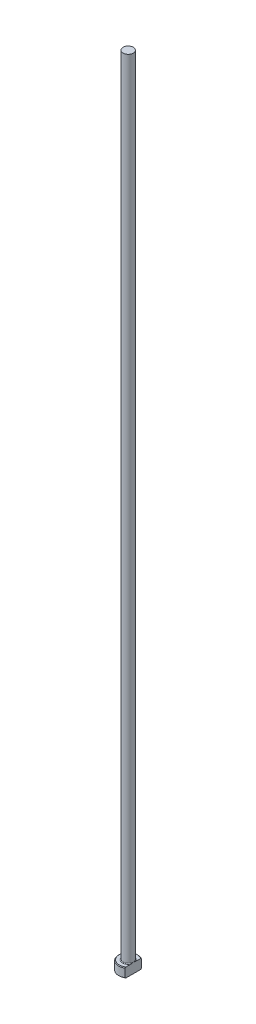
ISO-10303-21;
HEADER;
FILE_DESCRIPTION(('STEP AP214'),'2;1');
FILE_NAME('part.step','',(''),(''),'','','');
FILE_SCHEMA(('AUTOMOTIVE_DESIGN { 1 0 10303 214 1 1 1 1 }'));
ENDSEC;
DATA;
#1=APPLICATION_CONTEXT('core data for automotive mechanical design processes');
#2=APPLICATION_PROTOCOL_DEFINITION('international standard','automotive_design',2000,#1);
#3=PRODUCT_CONTEXT('',#1,'mechanical');
#4=PRODUCT('Part','Part','',(#3));
#5=PRODUCT_RELATED_PRODUCT_CATEGORY('part','',(#4));
#6=PRODUCT_DEFINITION_FORMATION('','',#4);
#7=PRODUCT_DEFINITION_CONTEXT('part definition',#1,'design');
#8=PRODUCT_DEFINITION('design','',#6,#7);
#9=PRODUCT_DEFINITION_SHAPE('','',#8);
#10=(LENGTH_UNIT() NAMED_UNIT(*) SI_UNIT(.MILLI.,.METRE.));
#11=(NAMED_UNIT(*) PLANE_ANGLE_UNIT() SI_UNIT($,.RADIAN.));
#12=(NAMED_UNIT(*) SI_UNIT($,.STERADIAN.) SOLID_ANGLE_UNIT());
#13=UNCERTAINTY_MEASURE_WITH_UNIT(LENGTH_MEASURE(1.E-05),#10,'distance_accuracy_value','');
#14=(GEOMETRIC_REPRESENTATION_CONTEXT(3) GLOBAL_UNCERTAINTY_ASSIGNED_CONTEXT((#13)) GLOBAL_UNIT_ASSIGNED_CONTEXT((#10,
#11,#12)) REPRESENTATION_CONTEXT('',''));
#15=CARTESIAN_POINT('',(0.,0.,0.));
#16=DIRECTION('',(0.,0.,1.));
#17=DIRECTION('',(1.,0.,0.));
#18=AXIS2_PLACEMENT_3D('',#15,#16,#17);
#19=CARTESIAN_POINT('',(0.,0.,0.));
#20=DIRECTION('',(0.,-1.,0.));
#21=DIRECTION('',(0.,0.,-1.));
#22=AXIS2_PLACEMENT_3D('',#19,#20,#21);
#23=PLANE('',#22);
#24=CARTESIAN_POINT('',(0.,0.,0.));
#25=DIRECTION('',(0.,-1.,0.));
#26=DIRECTION('',(0.,0.,-1.));
#27=AXIS2_PLACEMENT_3D('',#24,#25,#26);
#28=CIRCLE('',#27,2.8);
#29=CARTESIAN_POINT('',(1.59999999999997,0.,2.29782505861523));
#30=VERTEX_POINT('',#29);
#31=CARTESIAN_POINT('',(1.59999999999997,0.,-2.29782505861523));
#32=VERTEX_POINT('',#31);
#33=EDGE_CURVE('E98',#30,#32,#28,.T.);
#34=ORIENTED_EDGE('',*,*,#33,.T.);
#35=DIRECTION('',(0.,0.,1.));
#36=VECTOR('',#35,1.);
#37=CARTESIAN_POINT('',(1.59999999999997,0.,-2.53771550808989));
#38=LINE('',#37,#36);
#39=EDGE_CURVE('E83',#32,#30,#38,.T.);
#40=ORIENTED_EDGE('',*,*,#39,.T.);
#41=EDGE_LOOP('',(#34,#40));
#42=FACE_BOUND('',#41,.T.);
#43=ADVANCED_FACE('F32',(#42),#23,.T.);
#44=CARTESIAN_POINT('',(0.,259.958771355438,0.));
#45=DIRECTION('',(0.,1.,0.));
#46=DIRECTION('',(0.,0.,1.));
#47=AXIS2_PLACEMENT_3D('',#44,#45,#46);
#48=CYLINDRICAL_SURFACE('',#47,2.99999999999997);
#49=CARTESIAN_POINT('',(0.,2.80000000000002,0.));
#50=DIRECTION('',(0.,1.,0.));
#51=DIRECTION('',(0.,0.,1.));
#52=AXIS2_PLACEMENT_3D('',#49,#50,#51);
#53=CIRCLE('',#52,2.99999999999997);
#54=CARTESIAN_POINT('',(1.59999999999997,2.80000000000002,2.53771550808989));
#55=VERTEX_POINT('',#54);
#56=CARTESIAN_POINT('',(1.59999999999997,2.80000000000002,-2.53771550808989));
#57=VERTEX_POINT('',#56);
#58=EDGE_CURVE('E104',#55,#57,#53,.F.);
#59=ORIENTED_EDGE('',*,*,#58,.T.);
#60=DIRECTION('',(0.,-1.,0.));
#61=VECTOR('',#60,1.);
#62=CARTESIAN_POINT('',(1.59999999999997,250.,-2.53771550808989));
#63=LINE('',#62,#61);
#64=CARTESIAN_POINT('',(1.59999999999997,0.199999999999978,-2.53771550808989));
#65=VERTEX_POINT('',#64);
#66=EDGE_CURVE('E183',#57,#65,#63,.T.);
#67=ORIENTED_EDGE('',*,*,#66,.T.);
#68=CARTESIAN_POINT('',(0.,0.199999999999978,0.));
#69=DIRECTION('',(0.,-1.,0.));
#70=DIRECTION('',(0.,0.,-1.));
#71=AXIS2_PLACEMENT_3D('',#68,#69,#70);
#72=CIRCLE('',#71,2.99999999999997);
#73=CARTESIAN_POINT('',(1.59999999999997,0.199999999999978,2.53771550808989));
#74=VERTEX_POINT('',#73);
#75=EDGE_CURVE('E100',#65,#74,#72,.F.);
#76=ORIENTED_EDGE('',*,*,#75,.T.);
#77=DIRECTION('',(0.,-1.,0.));
#78=VECTOR('',#77,1.);
#79=CARTESIAN_POINT('',(1.59999999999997,250.,2.53771550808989));
#80=LINE('',#79,#78);
#81=EDGE_CURVE('E93',#55,#74,#80,.T.);
#82=ORIENTED_EDGE('',*,*,#81,.F.);
#83=EDGE_LOOP('',(#59,#67,#76,#82));
#84=FACE_BOUND('',#83,.T.);
#85=ADVANCED_FACE('F158',(#84),#48,.T.);
#86=CARTESIAN_POINT('',(-2.99999999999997,3.,0.));
#87=DIRECTION('',(0.,1.,0.));
#88=DIRECTION('',(0.,0.,1.));
#89=AXIS2_PLACEMENT_3D('',#86,#87,#88);
#90=PLANE('',#89);
#91=CARTESIAN_POINT('',(0.,3.,0.));
#92=DIRECTION('',(0.,1.,0.));
#93=DIRECTION('',(0.,0.,1.));
#94=AXIS2_PLACEMENT_3D('',#91,#92,#93);
#95=CIRCLE('',#94,2.80000000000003);
#96=CARTESIAN_POINT('',(1.59999999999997,3.,-2.29782505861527));
#97=VERTEX_POINT('',#96);
#98=CARTESIAN_POINT('',(1.59999999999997,3.,2.29782505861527));
#99=VERTEX_POINT('',#98);
#100=EDGE_CURVE('E178',#97,#99,#95,.T.);
#101=ORIENTED_EDGE('',*,*,#100,.T.);
#102=DIRECTION('',(0.,0.,-1.));
#103=VECTOR('',#102,1.);
#104=CARTESIAN_POINT('',(1.59999999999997,3.,0.));
#105=LINE('',#104,#103);
#106=CARTESIAN_POINT('',(1.59999999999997,2.99999999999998,0.824621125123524));
#107=VERTEX_POINT('',#106);
#108=EDGE_CURVE('E57',#99,#107,#105,.T.);
#109=ORIENTED_EDGE('',*,*,#108,.T.);
#110=CARTESIAN_POINT('',(0.,3.,0.));
#111=DIRECTION('',(0.,1.,0.));
#112=DIRECTION('',(0.,0.,1.));
#113=AXIS2_PLACEMENT_3D('',#110,#111,#112);
#114=CIRCLE('',#113,1.79999999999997);
#115=CARTESIAN_POINT('',(1.59999999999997,2.99999999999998,-0.824621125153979));
#116=VERTEX_POINT('',#115);
#117=EDGE_CURVE('E107',#107,#116,#114,.F.);
#118=ORIENTED_EDGE('',*,*,#117,.T.);
#119=EDGE_CURVE('E136',#116,#97,#105,.T.);
#120=ORIENTED_EDGE('',*,*,#119,.T.);
#121=EDGE_LOOP('',(#101,#109,#118,#120));
#122=FACE_BOUND('',#121,.T.);
#123=ADVANCED_FACE('F147',(#122),#90,.T.);
#124=CARTESIAN_POINT('',(0.,3.,0.));
#125=DIRECTION('',(0.,-1.,0.));
#126=DIRECTION('',(0.,0.,-1.));
#127=AXIS2_PLACEMENT_3D('',#124,#125,#126);
#128=CONICAL_SURFACE('',#127,2.80000000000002,0.785398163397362);
#129=ORIENTED_EDGE('',*,*,#58,.F.);
#130=CARTESIAN_POINT('',(1.59999999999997,-0.010183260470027,5.58553753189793));
#131=CARTESIAN_POINT('',(1.59999999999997,0.0972362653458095,5.47379440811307));
#132=CARTESIAN_POINT('',(1.59999999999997,0.204532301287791,5.36193239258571));
#133=CARTESIAN_POINT('',(1.59999999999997,0.418819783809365,5.13791519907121));
#134=CARTESIAN_POINT('',(1.59999999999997,0.525811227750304,5.02576001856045));
#135=CARTESIAN_POINT('',(1.59999999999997,0.846303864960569,4.68870684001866));
#136=CARTESIAN_POINT('',(1.59999999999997,1.05925853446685,4.46328850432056));
#137=CARTESIAN_POINT('',(1.59999999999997,1.48118306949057,4.01229981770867));
#138=CARTESIAN_POINT('',(1.59999999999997,1.69017139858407,3.78674682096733));
#139=CARTESIAN_POINT('',(1.59999999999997,2.00096196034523,3.44598591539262));
#140=CARTESIAN_POINT('',(1.59999999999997,2.10410381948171,3.33200088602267));
#141=CARTESIAN_POINT('',(1.59999999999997,2.30919104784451,3.10296070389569));
#142=CARTESIAN_POINT('',(1.59999999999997,2.411136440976,2.98790557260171));
#143=CARTESIAN_POINT('',(1.59999999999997,2.58757545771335,2.78593338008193));
#144=CARTESIAN_POINT('',(1.59999999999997,2.66243160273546,2.69933337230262));
#145=CARTESIAN_POINT('',(1.59999999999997,2.81098408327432,2.52513170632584));
#146=CARTESIAN_POINT('',(1.59999999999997,2.88468033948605,2.43752998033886));
#147=CARTESIAN_POINT('',(1.59999999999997,3.03092909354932,2.26058626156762));
#148=CARTESIAN_POINT('',(1.59999999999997,3.1034734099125,2.17123748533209));
#149=CARTESIAN_POINT('',(1.59999999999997,3.24645363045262,1.99088530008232));
#150=CARTESIAN_POINT('',(1.59999999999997,3.31688989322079,1.89988217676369));
#151=CARTESIAN_POINT('',(1.59999999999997,3.45543929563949,1.71486621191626));
#152=CARTESIAN_POINT('',(1.59999999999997,3.52352676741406,1.62083402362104));
#153=CARTESIAN_POINT('',(1.59999999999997,3.65543930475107,1.42966446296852));
#154=CARTESIAN_POINT('',(1.59999999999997,3.7192606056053,1.33252445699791));
#155=CARTESIAN_POINT('',(1.59999999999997,3.84005824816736,1.13468126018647));
#156=CARTESIAN_POINT('',(1.59999999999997,3.89706669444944,1.0339979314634));
#157=CARTESIAN_POINT('',(1.59999999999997,4.0008785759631,0.827509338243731));
#158=CARTESIAN_POINT('',(1.59999999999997,4.04770238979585,0.721714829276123));
#159=CARTESIAN_POINT('',(1.59999999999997,4.10597629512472,0.558809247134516));
#160=CARTESIAN_POINT('',(1.59999999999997,4.12339902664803,0.503846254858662));
#161=CARTESIAN_POINT('',(1.59999999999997,4.15340775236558,0.392598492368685));
#162=CARTESIAN_POINT('',(1.59999999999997,4.16599453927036,0.336313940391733));
#163=CARTESIAN_POINT('',(1.59999999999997,4.18546795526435,0.223146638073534));
#164=CARTESIAN_POINT('',(1.59999999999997,4.1923931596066,0.166270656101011));
#165=CARTESIAN_POINT('',(1.59999999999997,4.20016451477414,0.0521012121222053));
#166=CARTESIAN_POINT('',(1.59999999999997,4.20101133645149,-0.0051922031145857));
#167=CARTESIAN_POINT('',(1.59999999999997,4.19655603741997,-0.119606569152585));
#168=CARTESIAN_POINT('',(1.59999999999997,4.19124611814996,-0.176727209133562));
#169=CARTESIAN_POINT('',(1.59999999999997,4.17487728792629,-0.290132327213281));
#170=CARTESIAN_POINT('',(1.59999999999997,4.16381718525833,-0.346416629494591));
#171=CARTESIAN_POINT('',(1.59999999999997,4.13658168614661,-0.458175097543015));
#172=CARTESIAN_POINT('',(1.59999999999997,4.12036718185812,-0.513639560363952));
#173=CARTESIAN_POINT('',(1.59999999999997,4.08371568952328,-0.623133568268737));
#174=CARTESIAN_POINT('',(1.59999999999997,4.0632786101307,-0.677163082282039));
#175=CARTESIAN_POINT('',(1.59999999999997,4.01384079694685,-0.796206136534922));
#176=CARTESIAN_POINT('',(1.59999999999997,3.98395404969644,-0.860848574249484));
#177=CARTESIAN_POINT('',(1.59999999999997,3.9202487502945,-0.988182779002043));
#178=CARTESIAN_POINT('',(1.59999999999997,3.88642788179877,-1.0508733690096));
#179=CARTESIAN_POINT('',(1.59999999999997,3.81575061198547,-1.17466308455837));
#180=CARTESIAN_POINT('',(1.59999999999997,3.7788885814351,-1.23575897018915));
#181=CARTESIAN_POINT('',(1.59999999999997,3.70287361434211,-1.35651466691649));
#182=CARTESIAN_POINT('',(1.59999999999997,3.66372022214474,-1.4161741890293));
#183=CARTESIAN_POINT('',(1.59999999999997,3.54280392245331,-1.59458184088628));
#184=CARTESIAN_POINT('',(1.59999999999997,3.45833719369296,-1.71149244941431));
#185=CARTESIAN_POINT('',(1.59999999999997,3.2850848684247,-1.94177313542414));
#186=CARTESIAN_POINT('',(1.59999999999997,3.19630496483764,-2.05514757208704));
#187=CARTESIAN_POINT('',(1.59999999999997,2.98139222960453,-2.32229937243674));
#188=CARTESIAN_POINT('',(1.59999999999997,2.85392433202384,-2.47499901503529));
#189=CARTESIAN_POINT('',(1.59999999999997,2.5955750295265,-2.77749164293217));
#190=CARTESIAN_POINT('',(1.59999999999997,2.46469312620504,-2.92728419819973));
#191=CARTESIAN_POINT('',(1.59999999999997,2.20054459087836,-3.22502658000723));
#192=CARTESIAN_POINT('',(1.59999999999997,2.0672756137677,-3.37297432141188));
#193=CARTESIAN_POINT('',(1.59999999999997,1.79919464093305,-3.66744344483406));
#194=CARTESIAN_POINT('',(1.59999999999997,1.66438274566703,-3.81396491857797));
#195=CARTESIAN_POINT('',(1.59999999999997,1.40205824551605,-4.09689102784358));
#196=CARTESIAN_POINT('',(1.59999999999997,1.2746130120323,-4.23335821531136));
#197=CARTESIAN_POINT('',(1.59999999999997,1.01897493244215,-4.50559511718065));
#198=CARTESIAN_POINT('',(1.59999999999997,0.890782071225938,-4.64136481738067));
#199=CARTESIAN_POINT('',(1.59999999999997,0.634049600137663,-4.91211710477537));
#200=CARTESIAN_POINT('',(1.59999999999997,0.505511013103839,-5.04710066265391));
#201=CARTESIAN_POINT('',(1.59999999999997,0.247978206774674,-5.31662434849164));
#202=CARTESIAN_POINT('',(1.59999999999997,0.118984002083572,-5.45116449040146));
#203=CARTESIAN_POINT('',(1.59999999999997,-0.0101832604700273,-5.58553753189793));
#204=B_SPLINE_CURVE_WITH_KNOTS('',3,(#130,#131,#132,#133,#134,#135,#136,#137,#138,#139,#140,
#141,#142,#143,#144,#145,#146,#147,#148,#149,#150,#151,#152,#153,#154,#155,#156,#157,#158,#159,
#160,#161,#162,#163,#164,#165,#166,#167,#168,#169,#170,#171,#172,#173,#174,#175,#176,#177,#178,
#179,#180,#181,#182,#183,#184,#185,#186,#187,#188,#189,#190,#191,#192,#193,#194,#195,#196,#197,
#198,#199,#200,#201,#202,#203),.UNSPECIFIED.,.F.,.F.,(4,2,2,2,2,2,2,2,2,2,2,2,2,2,2,2,2,2,2,2,2,
2,2,2,2,2,2,2,2,2,2,2,2,2,2,2,4),(0.,0.465004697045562,0.930013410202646,1.86031116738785,
2.78275396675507,3.24391793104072,3.70507266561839,4.04847005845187,4.39189082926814,
4.73714054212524,5.08233118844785,5.43053718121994,5.7790465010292,6.12584271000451,
6.47193849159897,6.64473721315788,6.81750759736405,6.98909076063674,7.16065498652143,
7.33243676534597,7.50425415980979,7.67740760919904,7.85056480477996,8.0640331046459,
8.27762773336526,8.49162700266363,8.70566897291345,9.13816403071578,9.57010297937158,
10.166739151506,10.7634629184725,11.3608091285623,11.9581166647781,12.5182829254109,
13.0784605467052,13.6376414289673,14.1968045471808),.UNSPECIFIED.);
#205=EDGE_CURVE('E135',#55,#99,#204,.T.);
#206=ORIENTED_EDGE('',*,*,#205,.T.);
#207=ORIENTED_EDGE('',*,*,#100,.F.);
#208=EDGE_CURVE('E127',#97,#57,#204,.T.);
#209=ORIENTED_EDGE('',*,*,#208,.T.);
#210=EDGE_LOOP('',(#129,#206,#207,#209));
#211=FACE_BOUND('',#210,.T.);
#212=ADVANCED_FACE('F143',(#211),#128,.T.);
#213=CARTESIAN_POINT('',(0.,0.199999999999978,0.));
#214=DIRECTION('',(0.,1.,0.));
#215=DIRECTION('',(0.,0.,1.));
#216=AXIS2_PLACEMENT_3D('',#213,#214,#215);
#217=CONICAL_SURFACE('',#216,2.99999999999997,0.785398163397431);
#218=ORIENTED_EDGE('',*,*,#75,.F.);
#219=CARTESIAN_POINT('',(1.59999999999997,3.01018326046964,-5.58553753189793));
#220=CARTESIAN_POINT('',(1.59999999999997,2.90276373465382,-5.47379440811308));
#221=CARTESIAN_POINT('',(1.59999999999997,2.79546769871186,-5.36193239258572));
#222=CARTESIAN_POINT('',(1.59999999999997,2.58118021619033,-5.13791519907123));
#223=CARTESIAN_POINT('',(1.59999999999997,2.47418877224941,-5.02576001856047));
#224=CARTESIAN_POINT('',(1.59999999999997,2.1536961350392,-4.6887068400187));
#225=CARTESIAN_POINT('',(1.59999999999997,1.94074146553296,-4.46328850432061));
#226=CARTESIAN_POINT('',(1.59999999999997,1.51881693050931,-4.01229981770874));
#227=CARTESIAN_POINT('',(1.59999999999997,1.30982860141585,-3.78674682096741));
#228=CARTESIAN_POINT('',(1.59999999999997,0.999038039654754,-3.44598591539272));
#229=CARTESIAN_POINT('',(1.59999999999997,0.895896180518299,-3.33200088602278));
#230=CARTESIAN_POINT('',(1.59999999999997,0.690808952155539,-3.10296070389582));
#231=CARTESIAN_POINT('',(1.59999999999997,0.588863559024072,-2.98790557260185));
#232=CARTESIAN_POINT('',(1.59999999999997,0.412424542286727,-2.78593338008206));
#233=CARTESIAN_POINT('',(1.59999999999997,0.337568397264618,-2.69933337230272));
#234=CARTESIAN_POINT('',(1.59999999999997,0.189015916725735,-2.5251317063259));
#235=CARTESIAN_POINT('',(1.59999999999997,0.115319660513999,-2.43752998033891));
#236=CARTESIAN_POINT('',(1.59999999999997,-0.0309290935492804,-2.26058626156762));
#237=CARTESIAN_POINT('',(1.59999999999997,-0.103473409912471,-2.17123748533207));
#238=CARTESIAN_POINT('',(1.59999999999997,-0.246453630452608,-1.99088530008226));
#239=CARTESIAN_POINT('',(1.59999999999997,-0.316889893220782,-1.89988217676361));
#240=CARTESIAN_POINT('',(1.59999999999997,-0.455439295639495,-1.71486621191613));
#241=CARTESIAN_POINT('',(1.59999999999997,-0.523526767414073,-1.62083402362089));
#242=CARTESIAN_POINT('',(1.59999999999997,-0.655439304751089,-1.42966446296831));
#243=CARTESIAN_POINT('',(1.59999999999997,-0.719260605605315,-1.33252445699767));
#244=CARTESIAN_POINT('',(1.59999999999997,-0.840058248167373,-1.13468126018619));
#245=CARTESIAN_POINT('',(1.59999999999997,-0.897066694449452,-1.03399793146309));
#246=CARTESIAN_POINT('',(1.59999999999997,-1.0008785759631,-0.827509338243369));
#247=CARTESIAN_POINT('',(1.59999999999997,-1.04770238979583,-0.721714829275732));
#248=CARTESIAN_POINT('',(1.59999999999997,-1.10597629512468,-0.558809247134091));
#249=CARTESIAN_POINT('',(1.59999999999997,-1.12339902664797,-0.503846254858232));
#250=CARTESIAN_POINT('',(1.59999999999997,-1.15340775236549,-0.392598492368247));
#251=CARTESIAN_POINT('',(1.59999999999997,-1.16599453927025,-0.33631394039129));
#252=CARTESIAN_POINT('',(1.59999999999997,-1.18546795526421,-0.223146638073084));
#253=CARTESIAN_POINT('',(1.59999999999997,-1.19239315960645,-0.166270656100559));
#254=CARTESIAN_POINT('',(1.59999999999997,-1.20016451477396,-0.0521012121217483));
#255=CARTESIAN_POINT('',(1.59999999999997,-1.2010113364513,0.00519220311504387));
#256=CARTESIAN_POINT('',(1.59999999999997,-1.19655603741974,0.119606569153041));
#257=CARTESIAN_POINT('',(1.59999999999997,-1.19124611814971,0.176727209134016));
#258=CARTESIAN_POINT('',(1.59999999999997,-1.17487728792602,0.29013232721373));
#259=CARTESIAN_POINT('',(1.59999999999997,-1.16381718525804,0.346416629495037));
#260=CARTESIAN_POINT('',(1.59999999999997,-1.13658168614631,0.458175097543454));
#261=CARTESIAN_POINT('',(1.59999999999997,-1.1203671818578,0.513639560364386));
#262=CARTESIAN_POINT('',(1.59999999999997,-1.08371568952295,0.623133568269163));
#263=CARTESIAN_POINT('',(1.59999999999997,-1.06327861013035,0.677163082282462));
#264=CARTESIAN_POINT('',(1.59999999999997,-1.01384079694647,0.7962061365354));
#265=CARTESIAN_POINT('',(1.59999999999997,-0.983954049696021,0.860848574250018));
#266=CARTESIAN_POINT('',(1.59999999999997,-0.920248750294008,0.988182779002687));
#267=CARTESIAN_POINT('',(1.59999999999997,-0.886427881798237,1.0508733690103));
#268=CARTESIAN_POINT('',(1.59999999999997,-0.815750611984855,1.17466308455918));
#269=CARTESIAN_POINT('',(1.59999999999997,-0.778888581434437,1.23575897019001));
#270=CARTESIAN_POINT('',(1.59999999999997,-0.702873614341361,1.35651466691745));
#271=CARTESIAN_POINT('',(1.59999999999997,-0.663720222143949,1.41617418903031));
#272=CARTESIAN_POINT('',(1.59999999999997,-0.542803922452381,1.59458184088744));
#273=CARTESIAN_POINT('',(1.59999999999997,-0.458337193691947,1.71149244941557));
#274=CARTESIAN_POINT('',(1.59999999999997,-0.285084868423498,1.9417731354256));
#275=CARTESIAN_POINT('',(1.59999999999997,-0.196304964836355,2.0551475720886));
#276=CARTESIAN_POINT('',(1.59999999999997,0.0186077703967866,2.3222993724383));
#277=CARTESIAN_POINT('',(1.59999999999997,0.146075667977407,2.47499901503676));
#278=CARTESIAN_POINT('',(1.59999999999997,0.404424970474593,2.77749164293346));
#279=CARTESIAN_POINT('',(1.59999999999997,0.535306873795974,2.92728419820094));
#280=CARTESIAN_POINT('',(1.59999999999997,0.799455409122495,3.22502658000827));
#281=CARTESIAN_POINT('',(1.59999999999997,0.932724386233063,3.37297432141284));
#282=CARTESIAN_POINT('',(1.59999999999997,1.20080535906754,3.66744344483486));
#283=CARTESIAN_POINT('',(1.59999999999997,1.33561725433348,3.81396491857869));
#284=CARTESIAN_POINT('',(1.59999999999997,1.59794175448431,4.09689102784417));
#285=CARTESIAN_POINT('',(1.59999999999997,1.72538698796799,4.23335821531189));
#286=CARTESIAN_POINT('',(1.59999999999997,1.981025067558,4.50559511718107));
#287=CARTESIAN_POINT('',(1.59999999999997,2.10921792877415,4.64136481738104));
#288=CARTESIAN_POINT('',(1.59999999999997,2.36595039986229,4.91211710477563));
#289=CARTESIAN_POINT('',(1.59999999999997,2.49448898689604,5.04710066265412));
#290=CARTESIAN_POINT('',(1.59999999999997,2.75202179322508,5.31662434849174));
#291=CARTESIAN_POINT('',(1.59999999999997,2.88101599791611,5.45116449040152));
#292=CARTESIAN_POINT('',(1.59999999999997,3.01018326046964,5.58553753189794));
#293=B_SPLINE_CURVE_WITH_KNOTS('',3,(#219,#220,#221,#222,#223,#224,#225,#226,#227,#228,#229,
#230,#231,#232,#233,#234,#235,#236,#237,#238,#239,#240,#241,#242,#243,#244,#245,#246,#247,#248,
#249,#250,#251,#252,#253,#254,#255,#256,#257,#258,#259,#260,#261,#262,#263,#264,#265,#266,#267,
#268,#269,#270,#271,#272,#273,#274,#275,#276,#277,#278,#279,#280,#281,#282,#283,#284,#285,#286,
#287,#288,#289,#290,#291,#292),.UNSPECIFIED.,.F.,.F.,(4,2,2,2,2,2,2,2,2,2,2,2,2,2,2,2,2,2,2,2,2,
2,2,2,2,2,2,2,2,2,2,2,2,2,2,2,4),(0.,0.465004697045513,0.930013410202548,1.86031116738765,
2.78275396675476,3.24391793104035,3.70507266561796,4.0484700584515,4.39189082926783,
4.73714054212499,5.08233118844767,5.43053718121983,5.77904650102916,6.12584271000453,
6.47193849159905,6.64473721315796,6.81750759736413,6.98909076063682,7.16065498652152,
7.33243676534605,7.50425415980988,7.67740760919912,7.85056480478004,8.06403310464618,
8.27762773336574,8.4916270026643,8.70566897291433,9.13816403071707,9.57010297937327,
10.1667391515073,10.7634629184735,11.360809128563,11.9581166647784,12.5182829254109,
13.078460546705,13.6376414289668,14.1968045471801),.UNSPECIFIED.);
#294=EDGE_CURVE('E86',#65,#32,#293,.T.);
#295=ORIENTED_EDGE('',*,*,#294,.T.);
#296=ORIENTED_EDGE('',*,*,#33,.F.);
#297=EDGE_CURVE('E89',#30,#74,#293,.T.);
#298=ORIENTED_EDGE('',*,*,#297,.T.);
#299=EDGE_LOOP('',(#218,#295,#296,#298));
#300=FACE_BOUND('',#299,.T.);
#301=ADVANCED_FACE('F97',(#300),#217,.T.);
#302=CARTESIAN_POINT('',(0.,3.19999999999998,0.));
#303=DIRECTION('',(0.,1.,0.));
#304=DIRECTION('',(0.,0.,1.));
#305=AXIS2_PLACEMENT_3D('',#302,#303,#304);
#306=TOROIDAL_SURFACE('',#305,1.79999999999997,0.2);
#307=CARTESIAN_POINT('',(1.59999999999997,3.19999999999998,0.));
#308=CARTESIAN_POINT('',(1.59999999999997,3.20000050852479,4.54943754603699E-11));
#309=CARTESIAN_POINT('',(1.59999999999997,3.20000101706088,-1.26961255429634E-07));
#310=CARTESIAN_POINT('',(1.59999999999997,3.20000198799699,-5.15663776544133E-07));
#311=CARTESIAN_POINT('',(1.59999999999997,3.20000244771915,-7.82570768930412E-07));
#312=CARTESIAN_POINT('',(1.59999999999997,3.20000337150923,-1.42107859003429E-06));
#313=CARTESIAN_POINT('',(1.59999999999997,3.2000038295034,-1.8013897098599E-06));
#314=CARTESIAN_POINT('',(1.59999999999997,3.20000468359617,-2.61302269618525E-06));
#315=CARTESIAN_POINT('',(1.59999999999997,3.20000508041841,-3.04362154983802E-06));
#316=CARTESIAN_POINT('',(1.59999999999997,3.20000644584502,-4.61783099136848E-06));
#317=CARTESIAN_POINT('',(1.59999999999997,3.2000073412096,-5.82629496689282E-06));
#318=CARTESIAN_POINT('',(1.59999999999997,3.20000890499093,-8.29532278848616E-06));
#319=CARTESIAN_POINT('',(1.59999999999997,3.2000095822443,-9.55059430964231E-06));
#320=CARTESIAN_POINT('',(1.59999999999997,3.2000122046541,-1.4561779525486E-05));
#321=CARTESIAN_POINT('',(1.59999999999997,3.20001402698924,-1.8385925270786E-05));
#322=CARTESIAN_POINT('',(1.59999999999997,3.20001693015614,-2.58398167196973E-05));
#323=CARTESIAN_POINT('',(1.59999999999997,3.20001806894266,-2.9447492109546E-05));
#324=CARTESIAN_POINT('',(1.59999999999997,3.20002303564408,-4.5117550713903E-05));
#325=CARTESIAN_POINT('',(1.59999999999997,3.20002690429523,-5.71577768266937E-05));
#326=CARTESIAN_POINT('',(1.59999999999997,3.20003298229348,-7.95113108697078E-05));
#327=CARTESIAN_POINT('',(1.59999999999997,3.20003536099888,-8.97762976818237E-05));
#328=CARTESIAN_POINT('',(1.59999999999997,3.20005453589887,-0.000165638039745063));
#329=CARTESIAN_POINT('',(1.59999999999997,3.20007944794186,-0.000228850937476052));
#330=CARTESIAN_POINT('',(1.59999999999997,3.20017354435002,-0.000476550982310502));
#331=CARTESIAN_POINT('',(1.59999999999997,3.20023667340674,-0.000662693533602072));
#332=CARTESIAN_POINT('',(1.59999999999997,3.2004875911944,-0.00139193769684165));
#333=CARTESIAN_POINT('',(1.59999999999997,3.20068172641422,-0.00193335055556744));
#334=CARTESIAN_POINT('',(1.59999999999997,3.20147743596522,-0.00416279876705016));
#335=CARTESIAN_POINT('',(1.59999999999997,3.20207183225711,-0.00585269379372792));
#336=CARTESIAN_POINT('',(1.59999999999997,3.2087643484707,-0.0248666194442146));
#337=CARTESIAN_POINT('',(1.59999999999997,3.21490191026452,-0.0421807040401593));
#338=CARTESIAN_POINT('',(1.59999999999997,3.22687857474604,-0.0761752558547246));
#339=CARTESIAN_POINT('',(1.59999999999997,3.23272018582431,-0.092854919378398));
#340=CARTESIAN_POINT('',(1.59999999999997,3.2450295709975,-0.128242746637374));
#341=CARTESIAN_POINT('',(1.59999999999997,3.25148835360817,-0.146954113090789));
#342=CARTESIAN_POINT('',(1.59999999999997,3.26432449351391,-0.18462192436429));
#343=CARTESIAN_POINT('',(1.59999999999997,3.27070030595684,-0.203578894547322));
#344=CARTESIAN_POINT('',(1.59999999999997,3.2861130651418,-0.250227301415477));
#345=CARTESIAN_POINT('',(1.59999999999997,3.29503653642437,-0.277956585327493));
#346=CARTESIAN_POINT('',(1.59999999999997,3.31206503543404,-0.332930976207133));
#347=CARTESIAN_POINT('',(1.59999999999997,3.32018465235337,-0.360171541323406));
#348=CARTESIAN_POINT('',(1.59999999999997,3.33730366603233,-0.420681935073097));
#349=CARTESIAN_POINT('',(1.59999999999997,3.34612355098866,-0.454003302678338));
#350=CARTESIAN_POINT('',(1.59999999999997,3.36232017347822,-0.521270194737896));
#351=CARTESIAN_POINT('',(1.59999999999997,3.36968538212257,-0.555218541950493));
#352=CARTESIAN_POINT('',(1.59999999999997,3.38286655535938,-0.625950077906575));
#353=CARTESIAN_POINT('',(1.59999999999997,3.3885334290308,-0.6627618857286));
#354=CARTESIAN_POINT('',(1.59999999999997,3.3967820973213,-0.736647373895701));
#355=CARTESIAN_POINT('',(1.59999999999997,3.39937308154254,-0.773719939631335));
#356=CARTESIAN_POINT('',(1.59999999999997,3.40041949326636,-0.847207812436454));
#357=CARTESIAN_POINT('',(1.59999999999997,3.39895641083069,-0.88362147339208));
#358=CARTESIAN_POINT('',(1.59999999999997,3.39061157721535,-0.955314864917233));
#359=CARTESIAN_POINT('',(1.59999999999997,3.3838299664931,-0.990603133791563));
#360=CARTESIAN_POINT('',(1.59999999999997,3.36933665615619,-1.03710764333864));
#361=CARTESIAN_POINT('',(1.59999999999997,3.36495855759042,-1.04936206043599));
#362=CARTESIAN_POINT('',(1.59999999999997,3.35498242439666,-1.07342013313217));
#363=CARTESIAN_POINT('',(1.59999999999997,3.34938064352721,-1.08522227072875));
#364=CARTESIAN_POINT('',(1.59999999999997,3.33671785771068,-1.10815425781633));
#365=CARTESIAN_POINT('',(1.59999999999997,3.32964542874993,-1.11927790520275));
#366=CARTESIAN_POINT('',(1.59999999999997,3.31385032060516,-1.14028316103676));
#367=CARTESIAN_POINT('',(1.59999999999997,3.30513251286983,-1.15016829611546));
#368=CARTESIAN_POINT('',(1.59999999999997,3.2893714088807,-1.16476986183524));
#369=CARTESIAN_POINT('',(1.59999999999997,3.28286385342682,-1.17006219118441));
#370=CARTESIAN_POINT('',(1.59999999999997,3.26911414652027,-1.179603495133));
#371=CARTESIAN_POINT('',(1.59999999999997,3.2618722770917,-1.18385286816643));
#372=CARTESIAN_POINT('',(1.59999999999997,3.24665711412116,-1.19105502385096));
#373=CARTESIAN_POINT('',(1.59999999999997,3.23867649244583,-1.19399264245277));
#374=CARTESIAN_POINT('',(1.59999999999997,3.22228884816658,-1.19821047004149));
#375=CARTESIAN_POINT('',(1.59999999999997,3.21388246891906,-1.19949310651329));
#376=CARTESIAN_POINT('',(1.59999999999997,3.19822871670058,-1.20020429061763));
#377=CARTESIAN_POINT('',(1.59999999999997,3.19099166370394,-1.19987658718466));
#378=CARTESIAN_POINT('',(1.59999999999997,3.1766911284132,-1.19794337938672));
#379=CARTESIAN_POINT('',(1.59999999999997,3.16962767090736,-1.19633769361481));
#380=CARTESIAN_POINT('',(1.59999999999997,3.15619326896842,-1.19208069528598));
#381=CARTESIAN_POINT('',(1.59999999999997,3.14980538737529,-1.18948176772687));
#382=CARTESIAN_POINT('',(1.59999999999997,3.13747056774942,-1.18339991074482));
#383=CARTESIAN_POINT('',(1.59999999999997,3.13152374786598,-1.17991674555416));
#384=CARTESIAN_POINT('',(1.59999999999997,3.11701630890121,-1.17013377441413));
#385=CARTESIAN_POINT('',(1.59999999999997,3.10879365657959,-1.16333250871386));
#386=CARTESIAN_POINT('',(1.59999999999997,3.09352344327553,-1.14851362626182));
#387=CARTESIAN_POINT('',(1.59999999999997,3.08647946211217,-1.14049244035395));
#388=CARTESIAN_POINT('',(1.59999999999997,3.06978612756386,-1.11881325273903));
#389=CARTESIAN_POINT('',(1.59999999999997,3.06093454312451,-1.10454463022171));
#390=CARTESIAN_POINT('',(1.59999999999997,3.045486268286,-1.07488732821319));
#391=CARTESIAN_POINT('',(1.59999999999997,3.03889016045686,-1.05949836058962));
#392=CARTESIAN_POINT('',(1.59999999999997,3.02310414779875,-1.01585357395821));
#393=CARTESIAN_POINT('',(1.59999999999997,3.01588276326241,-0.98689334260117));
#394=CARTESIAN_POINT('',(1.59999999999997,3.00554634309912,-0.927965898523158));
#395=CARTESIAN_POINT('',(1.59999999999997,3.00248580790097,-0.89799049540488));
#396=CARTESIAN_POINT('',(1.59999999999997,2.99950013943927,-0.836442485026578));
#397=CARTESIAN_POINT('',(1.59999999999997,2.99973474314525,-0.804863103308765));
#398=CARTESIAN_POINT('',(1.59999999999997,3.00289974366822,-0.74177978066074));
#399=CARTESIAN_POINT('',(1.59999999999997,3.00583724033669,-0.710276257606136));
#400=CARTESIAN_POINT('',(1.59999999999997,3.01360294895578,-0.649223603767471));
#401=CARTESIAN_POINT('',(1.59999999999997,3.01832173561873,-0.61965999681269));
#402=CARTESIAN_POINT('',(1.59999999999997,3.02922114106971,-0.561003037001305));
#403=CARTESIAN_POINT('',(1.59999999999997,3.03539231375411,-0.531907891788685));
#404=CARTESIAN_POINT('',(1.59999999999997,3.05057454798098,-0.466833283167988));
#405=CARTESIAN_POINT('',(1.59999999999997,3.05991050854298,-0.430930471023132));
#406=CARTESIAN_POINT('',(1.59999999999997,3.08015300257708,-0.358646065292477));
#407=CARTESIAN_POINT('',(1.59999999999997,3.09109187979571,-0.322273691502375));
#408=CARTESIAN_POINT('',(1.59999999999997,3.11028869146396,-0.261379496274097));
#409=CARTESIAN_POINT('',(1.59999999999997,3.1182898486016,-0.236775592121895));
#410=CARTESIAN_POINT('',(1.59999999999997,3.13453271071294,-0.18793162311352));
#411=CARTESIAN_POINT('',(1.59999999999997,3.14277104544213,-0.163690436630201));
#412=CARTESIAN_POINT('',(1.59999999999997,3.158545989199,-0.117881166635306));
#413=CARTESIAN_POINT('',(1.59999999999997,3.16606272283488,-0.0963061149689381));
#414=CARTESIAN_POINT('',(1.59999999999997,3.18151152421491,-0.0523381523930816));
#415=CARTESIAN_POINT('',(1.59999999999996,3.18944823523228,-0.0299467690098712));
#416=CARTESIAN_POINT('',(1.59999999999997,3.19792848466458,-0.0058516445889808));
#417=CARTESIAN_POINT('',(1.59999999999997,3.19852328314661,-0.00416072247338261));
#418=CARTESIAN_POINT('',(1.59999999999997,3.19931909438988,-0.00193103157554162));
#419=CARTESIAN_POINT('',(1.59999999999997,3.19951294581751,-0.00139040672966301));
#420=CARTESIAN_POINT('',(1.59999999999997,3.19976352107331,-0.000662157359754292));
#421=CARTESIAN_POINT('',(1.59999999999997,3.19982658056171,-0.000476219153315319));
#422=CARTESIAN_POINT('',(1.59999999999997,3.19992058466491,-0.000228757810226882));
#423=CARTESIAN_POINT('',(1.59999999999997,3.19994548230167,-0.000165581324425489));
#424=CARTESIAN_POINT('',(1.59999999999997,3.19996464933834,-8.97604211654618E-05));
#425=CARTESIAN_POINT('',(1.59999999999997,3.19996702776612,-7.94979693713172E-05));
#426=CARTESIAN_POINT('',(1.59999999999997,3.19997310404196,-5.71501112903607E-05));
#427=CARTESIAN_POINT('',(1.59999999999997,3.19997697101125,-4.51129589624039E-05));
#428=CARTESIAN_POINT('',(1.59999999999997,3.19998193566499,-2.94463390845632E-05));
#429=CARTESIAN_POINT('',(1.59999999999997,3.19998307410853,-2.58390376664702E-05));
#430=CARTESIAN_POINT('',(1.59999999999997,3.1999859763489,-1.83858674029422E-05));
#431=CARTESIAN_POINT('',(1.59999999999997,3.19998779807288,-1.45620535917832E-05));
#432=CARTESIAN_POINT('',(1.59999999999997,3.19999041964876,-9.55118975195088E-06));
#433=CARTESIAN_POINT('',(1.59999999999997,3.19999109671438,-8.29594696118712E-06));
#434=CARTESIAN_POINT('',(1.59999999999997,3.19999266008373,-5.82694057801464E-06));
#435=CARTESIAN_POINT('',(1.59999999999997,3.19999355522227,-4.61846686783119E-06));
#436=CARTESIAN_POINT('',(1.59999999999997,3.19999492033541,-3.04420143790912E-06));
#437=CARTESIAN_POINT('',(1.59999999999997,3.19999531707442,-2.61357770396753E-06));
#438=CARTESIAN_POINT('',(1.59999999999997,3.19999617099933,-1.80187998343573E-06));
#439=CARTESIAN_POINT('',(1.59999999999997,3.19999662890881,-1.4215287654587E-06));
#440=CARTESIAN_POINT('',(1.59999999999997,3.19999755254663,-7.8292447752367E-07));
#441=CARTESIAN_POINT('',(1.59999999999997,3.199998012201,-5.1596356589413E-07));
#442=CARTESIAN_POINT('',(1.59999999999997,3.19999898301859,-1.27129000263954E-07));
#443=CARTESIAN_POINT('',(1.59999999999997,3.19999949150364,-4.54918281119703E-11));
#444=CARTESIAN_POINT('',(1.59999999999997,3.19999999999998,0.));
#445=B_SPLINE_CURVE_WITH_KNOTS('',3,(#307,#308,#309,#310,#311,#312,#313,#314,#315,#316,#317,
#318,#319,#320,#321,#322,#323,#324,#325,#326,#327,#328,#329,#330,#331,#332,#333,#334,#335,#336,
#337,#338,#339,#340,#341,#342,#343,#344,#345,#346,#347,#348,#349,#350,#351,#352,#353,#354,#355,
#356,#357,#358,#359,#360,#361,#362,#363,#364,#365,#366,#367,#368,#369,#370,#371,#372,#373,#374,
#375,#376,#377,#378,#379,#380,#381,#382,#383,#384,#385,#386,#387,#388,#389,#390,#391,#392,#393,
#394,#395,#396,#397,#398,#399,#400,#401,#402,#403,#404,#405,#406,#407,#408,#409,#410,#411,#412,
#413,#414,#415,#416,#417,#418,#419,#420,#421,#422,#423,#424,#425,#426,#427,#428,#429,#430,#431,
#432,#433,#434,#435,#436,#437,#438,#439,#440,#441,#442,#443,#444),.UNSPECIFIED.,.T.,.F.,(4,2,2,
2,2,2,2,2,2,2,2,2,2,2,2,2,2,2,2,2,2,2,2,2,2,2,2,2,2,2,2,2,2,2,2,2,2,2,2,2,2,2,2,2,2,2,2,2,2,2,2,
2,2,2,2,2,2,2,2,2,2,2,2,2,2,2,2,2,4),(0.,1.52634300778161E-06,3.11406916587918E-06,
4.89195151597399E-06,6.64684989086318E-06,1.11381074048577E-05,1.54135914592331E-05,
2.80880177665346E-05,3.94249647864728E-05,7.7360103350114E-05,0.000108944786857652,
0.000312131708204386,0.00090234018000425,0.00262715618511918,0.00800204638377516,
0.0631063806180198,0.116126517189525,0.175509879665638,0.235510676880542,0.322894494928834,
0.408161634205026,0.511541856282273,0.615711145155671,0.727355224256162,0.838664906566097,
0.947753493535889,1.05483601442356,1.09382604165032,1.13293715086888,1.17236425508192,
1.21167640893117,1.23676182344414,1.26183763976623,1.28719627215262,1.31251766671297,
1.33413541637,1.35575623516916,1.37636641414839,1.39698209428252,1.42881268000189,
1.46073825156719,1.51082746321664,1.56092960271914,1.64997182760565,1.74016947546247,
1.83475408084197,1.92958784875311,2.01935385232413,2.10855142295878,2.21980473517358,
2.33373085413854,2.4113451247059,2.48815160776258,2.55669374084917,2.62795640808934,
2.63333459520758,2.63505690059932,2.63564646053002,2.63584953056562,2.63588110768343,
2.6359190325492,2.63593036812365,2.63594304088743,2.63594731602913,2.63595180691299,
2.63595356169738,2.63595533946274,2.63595692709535,2.63595845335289),.UNSPECIFIED.);
#446=CARTESIAN_POINT('',(1.59999999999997,3.19999999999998,0.));
#447=VERTEX_POINT('',#446);
#448=EDGE_CURVE('E11',#116,#447,#445,.T.);
#449=ORIENTED_EDGE('',*,*,#448,.F.);
#450=ORIENTED_EDGE('',*,*,#117,.F.);
#451=CARTESIAN_POINT('',(1.59999999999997,3.19999999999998,0.));
#452=CARTESIAN_POINT('',(1.59999999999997,3.19999949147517,-4.54943940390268E-11));
#453=CARTESIAN_POINT('',(1.59999999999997,3.19999898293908,1.26961255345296E-07));
#454=CARTESIAN_POINT('',(1.59999999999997,3.19999801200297,5.1566377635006E-07));
#455=CARTESIAN_POINT('',(1.59999999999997,3.19999755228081,7.82570768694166E-07));
#456=CARTESIAN_POINT('',(1.59999999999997,3.19999662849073,1.4210785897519E-06));
#457=CARTESIAN_POINT('',(1.59999999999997,3.19999617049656,1.80138970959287E-06));
#458=CARTESIAN_POINT('',(1.59999999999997,3.19999531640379,2.61302269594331E-06));
#459=CARTESIAN_POINT('',(1.59999999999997,3.19999491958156,3.04362154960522E-06));
#460=CARTESIAN_POINT('',(1.59999999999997,3.19999355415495,4.61783099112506E-06));
#461=CARTESIAN_POINT('',(1.59999999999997,3.19999265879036,5.82629496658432E-06));
#462=CARTESIAN_POINT('',(1.59999999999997,3.19999109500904,8.29532278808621E-06));
#463=CARTESIAN_POINT('',(1.59999999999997,3.19999041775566,9.55059430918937E-06));
#464=CARTESIAN_POINT('',(1.59999999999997,3.19998779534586,1.45617795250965E-05));
#465=CARTESIAN_POINT('',(1.59999999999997,3.19998597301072,1.83859252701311E-05));
#466=CARTESIAN_POINT('',(1.59999999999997,3.19998306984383,2.58398167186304E-05));
#467=CARTESIAN_POINT('',(1.59999999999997,3.1999819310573,2.94474921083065E-05));
#468=CARTESIAN_POINT('',(1.59999999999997,3.19997696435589,4.51175507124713E-05));
#469=CARTESIAN_POINT('',(1.59999999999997,3.19997309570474,5.7157776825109E-05));
#470=CARTESIAN_POINT('',(1.59999999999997,3.19996701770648,7.95113108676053E-05));
#471=CARTESIAN_POINT('',(1.59999999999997,3.19996463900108,8.9776297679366E-05));
#472=CARTESIAN_POINT('',(1.59999999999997,3.19994546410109,0.000165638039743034));
#473=CARTESIAN_POINT('',(1.59999999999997,3.1999205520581,0.000228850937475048));
#474=CARTESIAN_POINT('',(1.59999999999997,3.19982645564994,0.000476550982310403));
#475=CARTESIAN_POINT('',(1.59999999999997,3.19976332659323,0.000662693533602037));
#476=CARTESIAN_POINT('',(1.59999999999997,3.19951240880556,0.0013919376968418));
#477=CARTESIAN_POINT('',(1.59999999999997,3.19931827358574,0.0019333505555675));
#478=CARTESIAN_POINT('',(1.59999999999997,3.19852256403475,0.00416279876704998));
#479=CARTESIAN_POINT('',(1.59999999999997,3.19792816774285,0.00585269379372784));
#480=CARTESIAN_POINT('',(1.59999999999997,3.19123565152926,0.0248666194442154));
#481=CARTESIAN_POINT('',(1.59999999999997,3.18509808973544,0.0421807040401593));
#482=CARTESIAN_POINT('',(1.59999999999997,3.17312142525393,0.0761752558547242));
#483=CARTESIAN_POINT('',(1.59999999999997,3.16727981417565,0.0928549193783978));
#484=CARTESIAN_POINT('',(1.59999999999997,3.15497042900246,0.128242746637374));
#485=CARTESIAN_POINT('',(1.59999999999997,3.14851164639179,0.146954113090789));
#486=CARTESIAN_POINT('',(1.59999999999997,3.13567550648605,0.18462192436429));
#487=CARTESIAN_POINT('',(1.59999999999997,3.12929969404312,0.203578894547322));
#488=CARTESIAN_POINT('',(1.59999999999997,3.11388693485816,0.250227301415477));
#489=CARTESIAN_POINT('',(1.59999999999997,3.10496346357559,0.277956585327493));
#490=CARTESIAN_POINT('',(1.59999999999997,3.08793496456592,0.332930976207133));
#491=CARTESIAN_POINT('',(1.59999999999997,3.0798153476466,0.360171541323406));
#492=CARTESIAN_POINT('',(1.59999999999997,3.06269633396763,0.420681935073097));
#493=CARTESIAN_POINT('',(1.59999999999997,3.0538764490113,0.454003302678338));
#494=CARTESIAN_POINT('',(1.59999999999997,3.03767982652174,0.521270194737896));
#495=CARTESIAN_POINT('',(1.59999999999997,3.03031461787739,0.555218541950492));
#496=CARTESIAN_POINT('',(1.59999999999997,3.01713344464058,0.625950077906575));
#497=CARTESIAN_POINT('',(1.59999999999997,3.01146657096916,0.6627618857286));
#498=CARTESIAN_POINT('',(1.59999999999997,3.00321790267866,0.736647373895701));
#499=CARTESIAN_POINT('',(1.59999999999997,3.00062691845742,0.773719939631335));
#500=CARTESIAN_POINT('',(1.59999999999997,2.9995805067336,0.847207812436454));
#501=CARTESIAN_POINT('',(1.59999999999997,3.00104358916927,0.88362147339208));
#502=CARTESIAN_POINT('',(1.59999999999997,3.00938842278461,0.955314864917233));
#503=CARTESIAN_POINT('',(1.59999999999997,3.01617003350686,0.990603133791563));
#504=CARTESIAN_POINT('',(1.59999999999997,3.03066334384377,1.03710764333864));
#505=CARTESIAN_POINT('',(1.59999999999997,3.03504144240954,1.04936206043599));
#506=CARTESIAN_POINT('',(1.59999999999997,3.04501757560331,1.07342013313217));
#507=CARTESIAN_POINT('',(1.59999999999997,3.05061935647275,1.08522227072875));
#508=CARTESIAN_POINT('',(1.59999999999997,3.06328214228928,1.10815425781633));
#509=CARTESIAN_POINT('',(1.59999999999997,3.07035457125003,1.11927790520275));
#510=CARTESIAN_POINT('',(1.59999999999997,3.0861496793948,1.14028316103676));
#511=CARTESIAN_POINT('',(1.59999999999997,3.09486748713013,1.15016829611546));
#512=CARTESIAN_POINT('',(1.59999999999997,3.11062859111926,1.16476986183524));
#513=CARTESIAN_POINT('',(1.59999999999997,3.11713614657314,1.17006219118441));
#514=CARTESIAN_POINT('',(1.59999999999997,3.13088585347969,1.179603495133));
#515=CARTESIAN_POINT('',(1.59999999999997,3.13812772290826,1.18385286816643));
#516=CARTESIAN_POINT('',(1.59999999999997,3.1533428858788,1.19105502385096));
#517=CARTESIAN_POINT('',(1.59999999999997,3.16132350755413,1.19399264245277));
#518=CARTESIAN_POINT('',(1.59999999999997,3.17771115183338,1.19821047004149));
#519=CARTESIAN_POINT('',(1.59999999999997,3.1861175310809,1.19949310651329));
#520=CARTESIAN_POINT('',(1.59999999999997,3.20177128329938,1.20020429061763));
#521=CARTESIAN_POINT('',(1.59999999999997,3.20900833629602,1.19987658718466));
#522=CARTESIAN_POINT('',(1.59999999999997,3.22330887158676,1.19794337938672));
#523=CARTESIAN_POINT('',(1.59999999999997,3.2303723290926,1.19633769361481));
#524=CARTESIAN_POINT('',(1.59999999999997,3.24380673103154,1.19208069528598));
#525=CARTESIAN_POINT('',(1.59999999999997,3.25019461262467,1.18948176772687));
#526=CARTESIAN_POINT('',(1.59999999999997,3.26252943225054,1.18339991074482));
#527=CARTESIAN_POINT('',(1.59999999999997,3.26847625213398,1.17991674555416));
#528=CARTESIAN_POINT('',(1.59999999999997,3.28298369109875,1.17013377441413));
#529=CARTESIAN_POINT('',(1.59999999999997,3.29120634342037,1.16333250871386));
#530=CARTESIAN_POINT('',(1.59999999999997,3.30647655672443,1.14851362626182));
#531=CARTESIAN_POINT('',(1.59999999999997,3.31352053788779,1.14049244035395));
#532=CARTESIAN_POINT('',(1.59999999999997,3.3302138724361,1.11881325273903));
#533=CARTESIAN_POINT('',(1.59999999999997,3.33906545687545,1.10454463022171));
#534=CARTESIAN_POINT('',(1.59999999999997,3.35451373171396,1.07488732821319));
#535=CARTESIAN_POINT('',(1.59999999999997,3.36110983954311,1.05949836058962));
#536=CARTESIAN_POINT('',(1.59999999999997,3.37689585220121,1.01585357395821));
#537=CARTESIAN_POINT('',(1.59999999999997,3.38411723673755,0.98689334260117));
#538=CARTESIAN_POINT('',(1.59999999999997,3.39445365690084,0.927965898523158));
#539=CARTESIAN_POINT('',(1.59999999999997,3.397514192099,0.89799049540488));
#540=CARTESIAN_POINT('',(1.59999999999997,3.40049986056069,0.836442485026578));
#541=CARTESIAN_POINT('',(1.59999999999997,3.40026525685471,0.804863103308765));
#542=CARTESIAN_POINT('',(1.59999999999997,3.39710025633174,0.74177978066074));
#543=CARTESIAN_POINT('',(1.59999999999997,3.39416275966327,0.710276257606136));
#544=CARTESIAN_POINT('',(1.59999999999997,3.38639705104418,0.649223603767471));
#545=CARTESIAN_POINT('',(1.59999999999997,3.38167826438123,0.61965999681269));
#546=CARTESIAN_POINT('',(1.59999999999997,3.37077885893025,0.561003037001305));
#547=CARTESIAN_POINT('',(1.59999999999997,3.36460768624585,0.531907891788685));
#548=CARTESIAN_POINT('',(1.59999999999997,3.34942545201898,0.466833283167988));
#549=CARTESIAN_POINT('',(1.59999999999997,3.34008949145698,0.430930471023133));
#550=CARTESIAN_POINT('',(1.59999999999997,3.31984699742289,0.358646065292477));
#551=CARTESIAN_POINT('',(1.59999999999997,3.30890812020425,0.322273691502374));
#552=CARTESIAN_POINT('',(1.59999999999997,3.289711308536,0.261379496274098));
#553=CARTESIAN_POINT('',(1.59999999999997,3.28171015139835,0.236775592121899));
#554=CARTESIAN_POINT('',(1.59999999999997,3.26546728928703,0.187931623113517));
#555=CARTESIAN_POINT('',(1.59999999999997,3.25722895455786,0.163690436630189));
#556=CARTESIAN_POINT('',(1.59999999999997,3.24145401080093,0.117881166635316));
#557=CARTESIAN_POINT('',(1.59999999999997,3.23393727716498,0.096306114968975));
#558=CARTESIAN_POINT('',(1.59999999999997,3.21848847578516,0.0523381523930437));
#559=CARTESIAN_POINT('',(1.59999999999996,3.21055176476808,0.0299467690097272));
#560=CARTESIAN_POINT('',(1.59999999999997,3.20207151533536,0.00585164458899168));
#561=CARTESIAN_POINT('',(1.59999999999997,3.20147671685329,0.00416072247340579));
#562=CARTESIAN_POINT('',(1.59999999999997,3.2006809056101,0.00193103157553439));
#563=CARTESIAN_POINT('',(1.59999999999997,3.2004870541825,0.0013904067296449));
#564=CARTESIAN_POINT('',(1.59999999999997,3.20023647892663,0.000662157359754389));
#565=CARTESIAN_POINT('',(1.59999999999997,3.2001734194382,0.000476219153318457));
#566=CARTESIAN_POINT('',(1.59999999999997,3.20007941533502,0.000228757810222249));
#567=CARTESIAN_POINT('',(1.59999999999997,3.20005451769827,0.000165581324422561));
#568=CARTESIAN_POINT('',(1.59999999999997,3.20003535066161,8.97604211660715E-05));
#569=CARTESIAN_POINT('',(1.59999999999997,3.20003297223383,7.94979693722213E-05));
#570=CARTESIAN_POINT('',(1.59999999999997,3.20002689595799,5.71501112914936E-05));
#571=CARTESIAN_POINT('',(1.59999999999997,3.20002302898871,4.51129589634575E-05));
#572=CARTESIAN_POINT('',(1.59999999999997,3.20001806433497,2.94463390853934E-05));
#573=CARTESIAN_POINT('',(1.59999999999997,3.20001692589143,2.58390376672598E-05));
#574=CARTESIAN_POINT('',(1.59999999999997,3.20001402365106,1.83858674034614E-05));
#575=CARTESIAN_POINT('',(1.59999999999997,3.20001220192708,1.45620535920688E-05));
#576=CARTESIAN_POINT('',(1.59999999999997,3.2000095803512,9.55118975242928E-06));
#577=CARTESIAN_POINT('',(1.59999999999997,3.20000890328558,8.29594696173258E-06));
#578=CARTESIAN_POINT('',(1.59999999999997,3.20000733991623,5.826940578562E-06));
#579=CARTESIAN_POINT('',(1.59999999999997,3.20000644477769,4.61846686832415E-06));
#580=CARTESIAN_POINT('',(1.59999999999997,3.20000507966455,3.04420143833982E-06));
#581=CARTESIAN_POINT('',(1.59999999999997,3.20000468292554,2.61357770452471E-06));
#582=CARTESIAN_POINT('',(1.59999999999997,3.20000382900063,1.80187998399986E-06));
#583=CARTESIAN_POINT('',(1.59999999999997,3.20000337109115,1.42152876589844E-06));
#584=CARTESIAN_POINT('',(1.59999999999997,3.20000244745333,7.82924477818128E-07));
#585=CARTESIAN_POINT('',(1.59999999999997,3.20000198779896,5.15963566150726E-07));
#586=CARTESIAN_POINT('',(1.59999999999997,3.20000101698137,1.2712900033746E-07));
#587=CARTESIAN_POINT('',(1.59999999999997,3.20000050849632,4.54918467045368E-11));
#588=CARTESIAN_POINT('',(1.59999999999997,3.19999999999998,0.));
#589=B_SPLINE_CURVE_WITH_KNOTS('',3,(#451,#452,#453,#454,#455,#456,#457,#458,#459,#460,#461,
#462,#463,#464,#465,#466,#467,#468,#469,#470,#471,#472,#473,#474,#475,#476,#477,#478,#479,#480,
#481,#482,#483,#484,#485,#486,#487,#488,#489,#490,#491,#492,#493,#494,#495,#496,#497,#498,#499,
#500,#501,#502,#503,#504,#505,#506,#507,#508,#509,#510,#511,#512,#513,#514,#515,#516,#517,#518,
#519,#520,#521,#522,#523,#524,#525,#526,#527,#528,#529,#530,#531,#532,#533,#534,#535,#536,#537,
#538,#539,#540,#541,#542,#543,#544,#545,#546,#547,#548,#549,#550,#551,#552,#553,#554,#555,#556,
#557,#558,#559,#560,#561,#562,#563,#564,#565,#566,#567,#568,#569,#570,#571,#572,#573,#574,#575,
#576,#577,#578,#579,#580,#581,#582,#583,#584,#585,#586,#587,#588),.UNSPECIFIED.,.T.,.F.,(4,2,2,
2,2,2,2,2,2,2,2,2,2,2,2,2,2,2,2,2,2,2,2,2,2,2,2,2,2,2,2,2,2,2,2,2,2,2,2,2,2,2,2,2,2,2,2,2,2,2,2,
2,2,2,2,2,2,2,2,2,2,2,2,2,2,2,2,2,4),(0.,1.52634300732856E-06,3.11406916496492E-06,
4.8919515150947E-06,6.64684988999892E-06,1.1138107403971E-05,1.54135914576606E-05,
2.80880177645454E-05,3.94249647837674E-05,7.73601033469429E-05,0.000108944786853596,
0.000312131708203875,0.000902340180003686,0.00262715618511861,0.0080020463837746,
0.063106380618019,0.116126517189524,0.175509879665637,0.235510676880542,0.322894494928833,
0.408161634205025,0.511541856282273,0.61571114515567,0.727355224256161,0.838664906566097,
0.947753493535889,1.05483601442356,1.09382604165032,1.13293715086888,1.17236425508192,
1.21167640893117,1.23676182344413,1.26183763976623,1.28719627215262,1.31251766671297,
1.33413541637,1.35575623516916,1.37636641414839,1.39698209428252,1.42881268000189,
1.46073825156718,1.51082746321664,1.56092960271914,1.64997182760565,1.74016947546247,
1.83475408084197,1.92958784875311,2.01935385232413,2.10855142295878,2.21980473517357,
2.33373085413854,2.4113451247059,2.48815160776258,2.55669374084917,2.62795640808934,
2.63333459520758,2.63505690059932,2.63564646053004,2.63584953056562,2.63588110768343,
2.6359190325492,2.63593036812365,2.63594304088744,2.63594731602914,2.635951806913,
2.63595356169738,2.63595533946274,2.63595692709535,2.63595845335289),.UNSPECIFIED.);
#590=EDGE_CURVE('E46',#447,#107,#589,.T.);
#591=ORIENTED_EDGE('',*,*,#590,.F.);
#592=CARTESIAN_POINT('',(0.,3.19999999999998,0.));
#593=DIRECTION('',(0.,1.,0.));
#594=DIRECTION('',(0.,0.,1.));
#595=AXIS2_PLACEMENT_3D('',#592,#593,#594);
#596=CIRCLE('',#595,1.59999999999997);
#597=EDGE_CURVE('E103',#447,#447,#596,.T.);
#598=ORIENTED_EDGE('',*,*,#597,.F.);
#599=EDGE_LOOP('',(#449,#450,#591,#598));
#600=FACE_BOUND('',#599,.T.);
#601=ADVANCED_FACE('F34',(#600),#306,.F.);
#602=CARTESIAN_POINT('',(0.,259.958771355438,0.));
#603=DIRECTION('',(0.,1.,0.));
#604=DIRECTION('',(0.,0.,1.));
#605=AXIS2_PLACEMENT_3D('',#602,#603,#604);
#606=CYLINDRICAL_SURFACE('',#605,1.59999999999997);
#607=ORIENTED_EDGE('',*,*,#597,.T.);
#608=EDGE_LOOP('',(#607));
#609=FACE_BOUND('',#608,.T.);
#610=CARTESIAN_POINT('',(0.,250.,0.));
#611=DIRECTION('',(0.,1.,0.));
#612=DIRECTION('',(0.,0.,1.));
#613=AXIS2_PLACEMENT_3D('',#610,#611,#612);
#614=CIRCLE('',#613,1.59999999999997);
#615=CARTESIAN_POINT('',(0.,250.,1.59999999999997));
#616=VERTEX_POINT('',#615);
#617=EDGE_CURVE('E101',#616,#616,#614,.T.);
#618=ORIENTED_EDGE('',*,*,#617,.F.);
#619=EDGE_LOOP('',(#618));
#620=FACE_BOUND('',#619,.T.);
#621=ADVANCED_FACE('F155',(#609,#620),#606,.T.);
#622=CARTESIAN_POINT('',(-1.59999999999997,250.,0.));
#623=DIRECTION('',(0.,1.,0.));
#624=DIRECTION('',(0.,0.,1.));
#625=AXIS2_PLACEMENT_3D('',#622,#623,#624);
#626=PLANE('',#625);
#627=ORIENTED_EDGE('',*,*,#617,.T.);
#628=EDGE_LOOP('',(#627));
#629=FACE_BOUND('',#628,.T.);
#630=ADVANCED_FACE('F121',(#629),#626,.T.);
#631=CARTESIAN_POINT('',(1.59999999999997,250.,-2.53771550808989));
#632=DIRECTION('',(1.,0.,0.));
#633=DIRECTION('',(0.,0.,-1.));
#634=AXIS2_PLACEMENT_3D('',#631,#632,#633);
#635=PLANE('',#634);
#636=ORIENTED_EDGE('',*,*,#66,.F.);
#637=ORIENTED_EDGE('',*,*,#208,.F.);
#638=ORIENTED_EDGE('',*,*,#119,.F.);
#639=ORIENTED_EDGE('',*,*,#448,.T.);
#640=ORIENTED_EDGE('',*,*,#590,.T.);
#641=ORIENTED_EDGE('',*,*,#108,.F.);
#642=ORIENTED_EDGE('',*,*,#205,.F.);
#643=ORIENTED_EDGE('',*,*,#81,.T.);
#644=ORIENTED_EDGE('',*,*,#297,.F.);
#645=ORIENTED_EDGE('',*,*,#39,.F.);
#646=ORIENTED_EDGE('',*,*,#294,.F.);
#647=EDGE_LOOP('',(#636,#637,#638,#639,#640,#641,#642,#643,#644,#645,#646));
#648=FACE_BOUND('',#647,.T.);
#649=ADVANCED_FACE('F85',(#648),#635,.T.);
#650=CLOSED_SHELL('',(#43,#85,#123,#212,#301,#601,#621,#630,#649));
#651=MANIFOLD_SOLID_BREP('B2',#650);
#652=ADVANCED_BREP_SHAPE_REPRESENTATION('',(#18,#651),#14);
#653=SHAPE_DEFINITION_REPRESENTATION(#9,#652);
ENDSEC;
END-ISO-10303-21;
